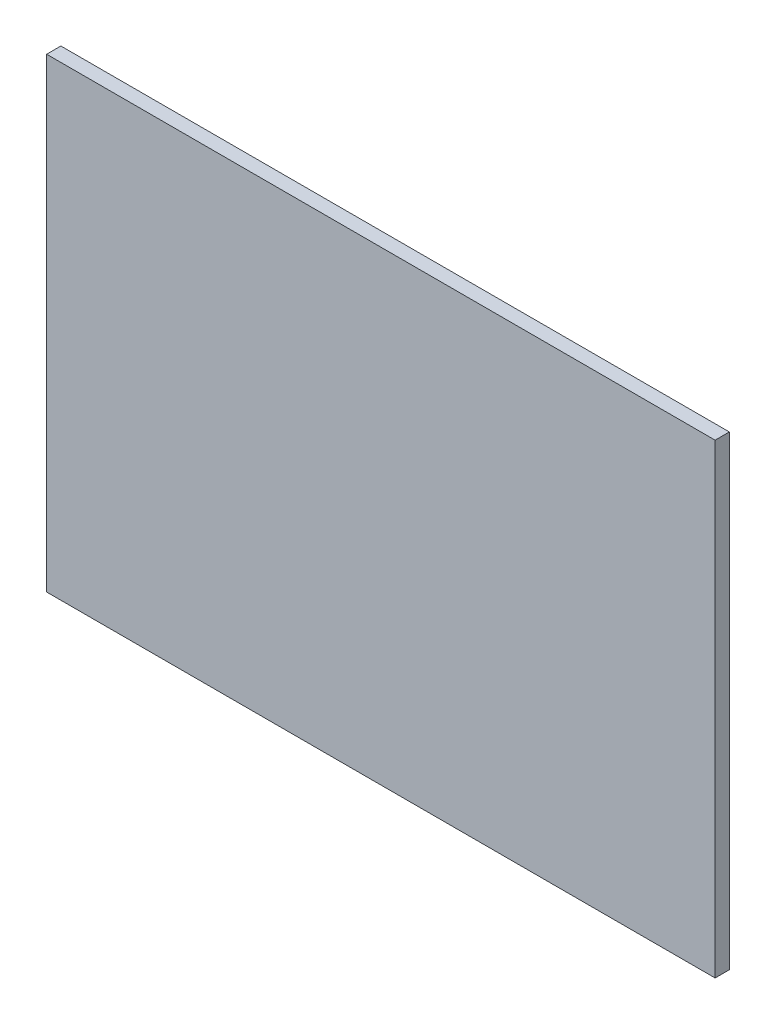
ISO-10303-21;
HEADER;
FILE_DESCRIPTION(('STEP AP214'),'2;1');
FILE_NAME('part.step','',(''),(''),'','','');
FILE_SCHEMA(('AUTOMOTIVE_DESIGN { 1 0 10303 214 1 1 1 1 }'));
ENDSEC;
DATA;
#1=APPLICATION_CONTEXT('core data for automotive mechanical design processes');
#2=APPLICATION_PROTOCOL_DEFINITION('international standard','automotive_design',2000,#1);
#3=PRODUCT_CONTEXT('',#1,'mechanical');
#4=PRODUCT('Part','Part','',(#3));
#5=PRODUCT_RELATED_PRODUCT_CATEGORY('part','',(#4));
#6=PRODUCT_DEFINITION_FORMATION('','',#4);
#7=PRODUCT_DEFINITION_CONTEXT('part definition',#1,'design');
#8=PRODUCT_DEFINITION('design','',#6,#7);
#9=PRODUCT_DEFINITION_SHAPE('','',#8);
#10=(LENGTH_UNIT() NAMED_UNIT(*) SI_UNIT(.MILLI.,.METRE.));
#11=(NAMED_UNIT(*) PLANE_ANGLE_UNIT() SI_UNIT($,.RADIAN.));
#12=(NAMED_UNIT(*) SI_UNIT($,.STERADIAN.) SOLID_ANGLE_UNIT());
#13=UNCERTAINTY_MEASURE_WITH_UNIT(LENGTH_MEASURE(1.E-05),#10,'distance_accuracy_value','');
#14=(GEOMETRIC_REPRESENTATION_CONTEXT(3) GLOBAL_UNCERTAINTY_ASSIGNED_CONTEXT((#13)) GLOBAL_UNIT_ASSIGNED_CONTEXT((#10,
#11,#12)) REPRESENTATION_CONTEXT('',''));
#15=CARTESIAN_POINT('',(0.,0.,0.));
#16=DIRECTION('',(0.,0.,1.));
#17=DIRECTION('',(1.,0.,0.));
#18=AXIS2_PLACEMENT_3D('',#15,#16,#17);
#19=CARTESIAN_POINT('',(25.4,831.85,-1219.2));
#20=DIRECTION('',(1.,0.,0.));
#21=DIRECTION('',(0.,0.,-1.));
#22=AXIS2_PLACEMENT_3D('',#19,#20,#21);
#23=PLANE('',#22);
#24=DIRECTION('',(0.,0.,1.));
#25=VECTOR('',#24,1.);
#26=CARTESIAN_POINT('',(25.4,0.,-1219.2));
#27=LINE('',#26,#25);
#28=CARTESIAN_POINT('',(25.4,0.,-1219.2));
#29=VERTEX_POINT('',#28);
#30=CARTESIAN_POINT('',(25.4,0.,-1193.8));
#31=VERTEX_POINT('',#30);
#32=EDGE_CURVE('E95',#29,#31,#27,.T.);
#33=ORIENTED_EDGE('',*,*,#32,.T.);
#34=DIRECTION('',(0.,-1.,0.));
#35=VECTOR('',#34,1.);
#36=CARTESIAN_POINT('',(25.4,831.85,-1193.8));
#37=LINE('',#36,#35);
#38=CARTESIAN_POINT('',(25.4,831.85,-1193.8));
#39=VERTEX_POINT('',#38);
#40=EDGE_CURVE('E11',#39,#31,#37,.T.);
#41=ORIENTED_EDGE('',*,*,#40,.F.);
#42=DIRECTION('',(0.,0.,1.));
#43=VECTOR('',#42,1.);
#44=CARTESIAN_POINT('',(25.4,831.85,-1219.2));
#45=LINE('',#44,#43);
#46=CARTESIAN_POINT('',(25.4,831.85,-1219.2));
#47=VERTEX_POINT('',#46);
#48=EDGE_CURVE('E83',#47,#39,#45,.T.);
#49=ORIENTED_EDGE('',*,*,#48,.F.);
#50=DIRECTION('',(0.,-1.,0.));
#51=VECTOR('',#50,1.);
#52=CARTESIAN_POINT('',(25.4,831.85,-1219.2));
#53=LINE('',#52,#51);
#54=EDGE_CURVE('E91',#47,#29,#53,.T.);
#55=ORIENTED_EDGE('',*,*,#54,.T.);
#56=EDGE_LOOP('',(#33,#41,#49,#55));
#57=FACE_BOUND('',#56,.T.);
#58=ADVANCED_FACE('F32',(#57),#23,.F.);
#59=CARTESIAN_POINT('',(25.4,831.85,-1193.8));
#60=DIRECTION('',(0.,0.,-1.));
#61=DIRECTION('',(-1.,0.,0.));
#62=AXIS2_PLACEMENT_3D('',#59,#60,#61);
#63=PLANE('',#62);
#64=DIRECTION('',(1.,0.,0.));
#65=VECTOR('',#64,1.);
#66=CARTESIAN_POINT('',(25.4,0.,-1193.8));
#67=LINE('',#66,#65);
#68=CARTESIAN_POINT('',(1219.2,0.,-1193.8));
#69=VERTEX_POINT('',#68);
#70=EDGE_CURVE('E87',#31,#69,#67,.T.);
#71=ORIENTED_EDGE('',*,*,#70,.T.);
#72=DIRECTION('',(0.,-1.,0.));
#73=VECTOR('',#72,1.);
#74=CARTESIAN_POINT('',(1219.2,831.85,-1193.8));
#75=LINE('',#74,#73);
#76=CARTESIAN_POINT('',(1219.2,831.85,-1193.8));
#77=VERTEX_POINT('',#76);
#78=EDGE_CURVE('E40',#77,#69,#75,.T.);
#79=ORIENTED_EDGE('',*,*,#78,.F.);
#80=DIRECTION('',(1.,0.,0.));
#81=VECTOR('',#80,1.);
#82=CARTESIAN_POINT('',(25.4,831.85,-1193.8));
#83=LINE('',#82,#81);
#84=EDGE_CURVE('E78',#39,#77,#83,.T.);
#85=ORIENTED_EDGE('',*,*,#84,.F.);
#86=ORIENTED_EDGE('',*,*,#40,.T.);
#87=EDGE_LOOP('',(#71,#79,#85,#86));
#88=FACE_BOUND('',#87,.T.);
#89=ADVANCED_FACE('F86',(#88),#63,.F.);
#90=CARTESIAN_POINT('',(1219.2,831.85,-1219.2));
#91=DIRECTION('',(-1.,0.,0.));
#92=DIRECTION('',(0.,0.,1.));
#93=AXIS2_PLACEMENT_3D('',#90,#91,#92);
#94=PLANE('',#93);
#95=DIRECTION('',(0.,0.,-1.));
#96=VECTOR('',#95,1.);
#97=CARTESIAN_POINT('',(1219.2,0.,-1219.2));
#98=LINE('',#97,#96);
#99=CARTESIAN_POINT('',(1219.2,0.,-1219.2));
#100=VERTEX_POINT('',#99);
#101=EDGE_CURVE('E65',#69,#100,#98,.T.);
#102=ORIENTED_EDGE('',*,*,#101,.T.);
#103=DIRECTION('',(0.,-1.,0.));
#104=VECTOR('',#103,1.);
#105=CARTESIAN_POINT('',(1219.2,831.85,-1219.2));
#106=LINE('',#105,#104);
#107=CARTESIAN_POINT('',(1219.2,831.85,-1219.2));
#108=VERTEX_POINT('',#107);
#109=EDGE_CURVE('E88',#108,#100,#106,.T.);
#110=ORIENTED_EDGE('',*,*,#109,.F.);
#111=DIRECTION('',(0.,0.,-1.));
#112=VECTOR('',#111,1.);
#113=CARTESIAN_POINT('',(1219.2,831.85,-1219.2));
#114=LINE('',#113,#112);
#115=EDGE_CURVE('E81',#77,#108,#114,.T.);
#116=ORIENTED_EDGE('',*,*,#115,.F.);
#117=ORIENTED_EDGE('',*,*,#78,.T.);
#118=EDGE_LOOP('',(#102,#110,#116,#117));
#119=FACE_BOUND('',#118,.T.);
#120=ADVANCED_FACE('F89',(#119),#94,.F.);
#121=CARTESIAN_POINT('',(25.4,831.85,-1219.2));
#122=DIRECTION('',(0.,0.,1.));
#123=DIRECTION('',(1.,0.,0.));
#124=AXIS2_PLACEMENT_3D('',#121,#122,#123);
#125=PLANE('',#124);
#126=DIRECTION('',(-1.,0.,0.));
#127=VECTOR('',#126,1.);
#128=CARTESIAN_POINT('',(25.4,0.,-1219.2));
#129=LINE('',#128,#127);
#130=EDGE_CURVE('E71',#100,#29,#129,.T.);
#131=ORIENTED_EDGE('',*,*,#130,.T.);
#132=ORIENTED_EDGE('',*,*,#54,.F.);
#133=DIRECTION('',(-1.,0.,0.));
#134=VECTOR('',#133,1.);
#135=CARTESIAN_POINT('',(25.4,831.85,-1219.2));
#136=LINE('',#135,#134);
#137=EDGE_CURVE('E48',#108,#47,#136,.T.);
#138=ORIENTED_EDGE('',*,*,#137,.F.);
#139=ORIENTED_EDGE('',*,*,#109,.T.);
#140=EDGE_LOOP('',(#131,#132,#138,#139));
#141=FACE_BOUND('',#140,.T.);
#142=ADVANCED_FACE('F102',(#141),#125,.F.);
#143=CARTESIAN_POINT('',(0.,831.85,0.));
#144=DIRECTION('',(0.,1.,0.));
#145=DIRECTION('',(0.,0.,1.));
#146=AXIS2_PLACEMENT_3D('',#143,#144,#145);
#147=PLANE('',#146);
#148=ORIENTED_EDGE('',*,*,#48,.T.);
#149=ORIENTED_EDGE('',*,*,#84,.T.);
#150=ORIENTED_EDGE('',*,*,#115,.T.);
#151=ORIENTED_EDGE('',*,*,#137,.T.);
#152=EDGE_LOOP('',(#148,#149,#150,#151));
#153=FACE_BOUND('',#152,.T.);
#154=ADVANCED_FACE('F79',(#153),#147,.T.);
#155=CARTESIAN_POINT('',(0.,0.,0.));
#156=DIRECTION('',(0.,1.,0.));
#157=DIRECTION('',(0.,0.,1.));
#158=AXIS2_PLACEMENT_3D('',#155,#156,#157);
#159=PLANE('',#158);
#160=ORIENTED_EDGE('',*,*,#32,.F.);
#161=ORIENTED_EDGE('',*,*,#130,.F.);
#162=ORIENTED_EDGE('',*,*,#101,.F.);
#163=ORIENTED_EDGE('',*,*,#70,.F.);
#164=EDGE_LOOP('',(#160,#161,#162,#163));
#165=FACE_BOUND('',#164,.T.);
#166=ADVANCED_FACE('F105',(#165),#159,.F.);
#167=CLOSED_SHELL('',(#58,#89,#120,#142,#154,#166));
#168=MANIFOLD_SOLID_BREP('B2',#167);
#169=ADVANCED_BREP_SHAPE_REPRESENTATION('',(#18,#168),#14);
#170=SHAPE_DEFINITION_REPRESENTATION(#9,#169);
ENDSEC;
END-ISO-10303-21;
